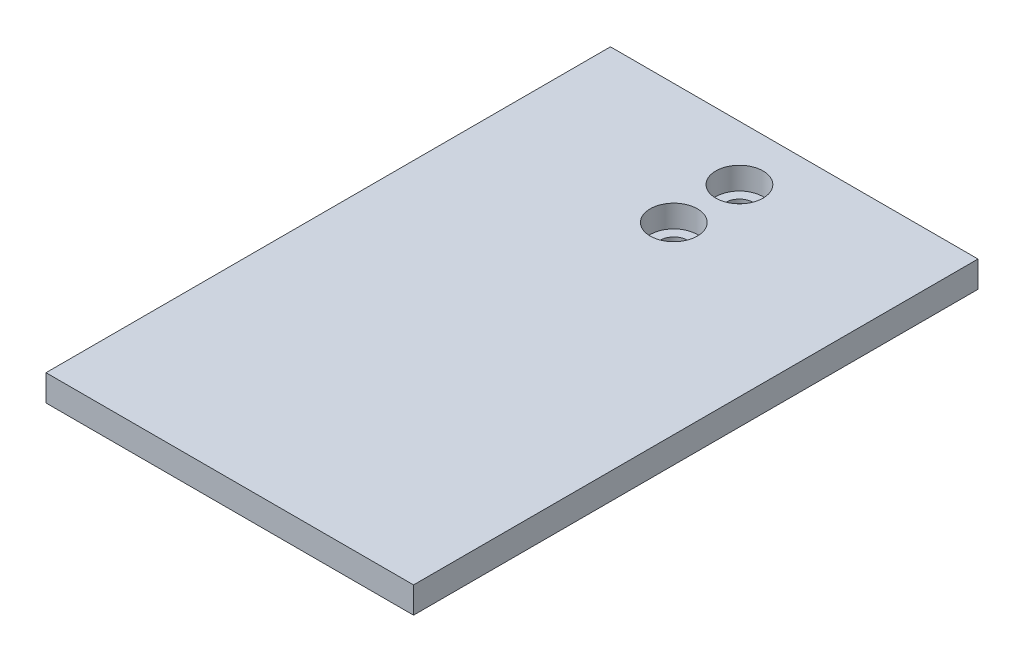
from build123d import *

# Parameters (mm, degrees)
BOSS_EXTRUDE1_DEPTH      = 3
BOSS_EXTRUDE1_DEPTH_BACK = 1
SKETCH1_W                = 58
SKETCH1_H                = 88
SKETCH3_R                = 3.6
CUT_EXTRUDE1_DEPTH       = 3.4
SKETCH4_R                = 2.1
CUT_EXTRUDE2_DEPTH       = 2
SKETCH5_OUTSIDE_W        = 81.094
SKETCH5_OUTSIDE_H        = 111.094
SKETCH5_OUTSIDE_W_2      = 56
SKETCH5_OUTSIDE_H_2      = 86
CUT_EXTRUDE3_DEPTH       = 10


with BuildPart() as part:
    # Sketch1 → Boss-Extrude1 (new, two sides: drawn at the far end of the back side and taken through both)
    with BuildSketch(Plane(origin=(0, 0, 0), x_dir=(1, 0, 0), z_dir=(0, 1, 0)).offset(-BOSS_EXTRUDE1_DEPTH_BACK)):
        Rectangle(SKETCH1_W, SKETCH1_H)
    extrude(amount=BOSS_EXTRUDE1_DEPTH + BOSS_EXTRUDE1_DEPTH_BACK)

    # Sketch3 → Cut-Extrude1 (cut)
    with BuildSketch(Plane(origin=(0, 3, 0), x_dir=(1, 0, 0), z_dir=(0, 1, 0))):
        with Locations(Location((0, 34.651995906, 0), (0, 0, 270))):
            Circle(SKETCH3_R)
        with Locations(Location((0, 24.651995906, 0), (0, 0, 270))):
            Circle(SKETCH3_R)
    extrude(amount=-CUT_EXTRUDE1_DEPTH, mode=Mode.SUBTRACT)

    # Sketch4 → Cut-Extrude2 (cut)
    with BuildSketch(Plane(origin=(0, -0.4, 0), x_dir=(1, 0, 0), z_dir=(0, 1, 0))):
        with Locations(Location((0, 34.651995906, 0), (0, 0, 270))):
            Circle(SKETCH4_R)
        with Locations(Location((0, 24.651995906, 0), (0, 0, 270))):
            Circle(SKETCH4_R)
    extrude(amount=-CUT_EXTRUDE2_DEPTH, mode=Mode.SUBTRACT)

    # Sketch5 outside → Cut-Extrude3 (cut)
    with BuildSketch(Plane(origin=(0, 3, 0), x_dir=(1, 0, 0), z_dir=(0, 1, 0))):
        Rectangle(SKETCH5_OUTSIDE_W, SKETCH5_OUTSIDE_H)
        Rectangle(SKETCH5_OUTSIDE_W_2, SKETCH5_OUTSIDE_H_2, mode=Mode.SUBTRACT)
    extrude(amount=-CUT_EXTRUDE3_DEPTH, mode=Mode.SUBTRACT)


solid = part.part
